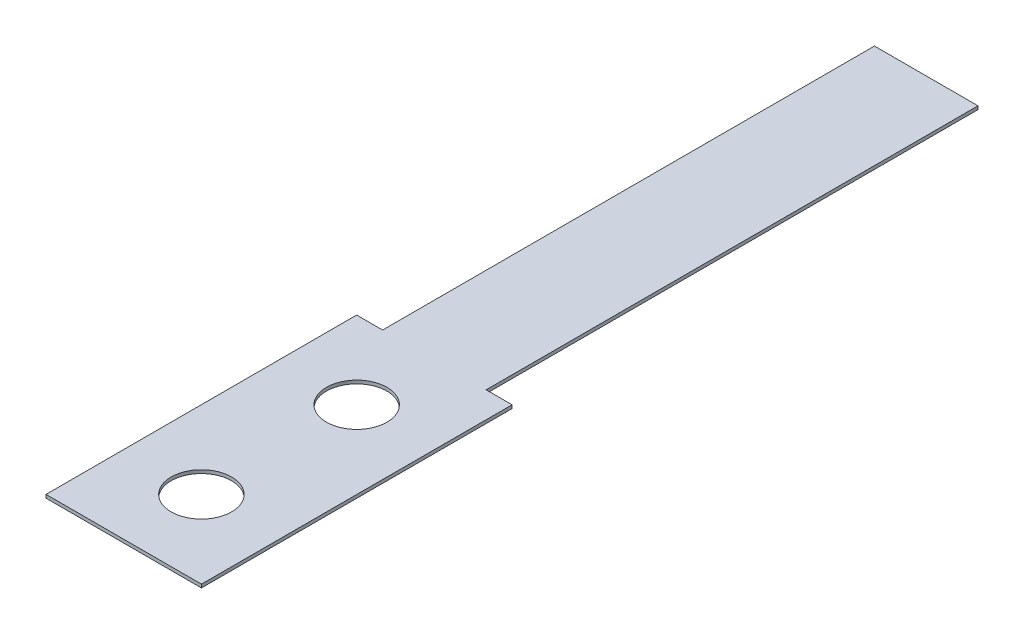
ISO-10303-21;
HEADER;
FILE_DESCRIPTION(('STEP AP214'),'2;1');
FILE_NAME('part.step','',(''),(''),'','','');
FILE_SCHEMA(('AUTOMOTIVE_DESIGN { 1 0 10303 214 1 1 1 1 }'));
ENDSEC;
DATA;
#1=APPLICATION_CONTEXT('core data for automotive mechanical design processes');
#2=APPLICATION_PROTOCOL_DEFINITION('international standard','automotive_design',2000,#1);
#3=PRODUCT_CONTEXT('',#1,'mechanical');
#4=PRODUCT('Part','Part','',(#3));
#5=PRODUCT_RELATED_PRODUCT_CATEGORY('part','',(#4));
#6=PRODUCT_DEFINITION_FORMATION('','',#4);
#7=PRODUCT_DEFINITION_CONTEXT('part definition',#1,'design');
#8=PRODUCT_DEFINITION('design','',#6,#7);
#9=PRODUCT_DEFINITION_SHAPE('','',#8);
#10=(LENGTH_UNIT() NAMED_UNIT(*) SI_UNIT(.MILLI.,.METRE.));
#11=(NAMED_UNIT(*) PLANE_ANGLE_UNIT() SI_UNIT($,.RADIAN.));
#12=(NAMED_UNIT(*) SI_UNIT($,.STERADIAN.) SOLID_ANGLE_UNIT());
#13=UNCERTAINTY_MEASURE_WITH_UNIT(LENGTH_MEASURE(1.E-05),#10,'distance_accuracy_value','');
#14=(GEOMETRIC_REPRESENTATION_CONTEXT(3) GLOBAL_UNCERTAINTY_ASSIGNED_CONTEXT((#13)) GLOBAL_UNIT_ASSIGNED_CONTEXT((#10,
#11,#12)) REPRESENTATION_CONTEXT('',''));
#15=CARTESIAN_POINT('',(0.,0.,0.));
#16=DIRECTION('',(0.,0.,1.));
#17=DIRECTION('',(1.,0.,0.));
#18=AXIS2_PLACEMENT_3D('',#15,#16,#17);
#19=CARTESIAN_POINT('',(-4.76631,-0.2032,-9.525));
#20=DIRECTION('',(0.,0.,-1.));
#21=DIRECTION('',(-1.,0.,0.));
#22=AXIS2_PLACEMENT_3D('',#19,#20,#21);
#23=PLANE('',#22);
#24=DIRECTION('',(-1.,0.,0.));
#25=VECTOR('',#24,1.);
#26=CARTESIAN_POINT('',(-4.76631,-0.2032,-9.525));
#27=LINE('',#26,#25);
#28=CARTESIAN_POINT('',(4.76631,-0.2032,-9.525));
#29=VERTEX_POINT('',#28);
#30=CARTESIAN_POINT('',(3.175,-0.2032,-9.525));
#31=VERTEX_POINT('',#30);
#32=EDGE_CURVE('E173',#29,#31,#27,.T.);
#33=ORIENTED_EDGE('',*,*,#32,.T.);
#34=DIRECTION('',(0.,1.,0.));
#35=VECTOR('',#34,1.);
#36=CARTESIAN_POINT('',(3.175,-0.2032,-9.525));
#37=LINE('',#36,#35);
#38=CARTESIAN_POINT('',(3.17499999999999,0.,-9.525));
#39=VERTEX_POINT('',#38);
#40=EDGE_CURVE('E129',#31,#39,#37,.T.);
#41=ORIENTED_EDGE('',*,*,#40,.T.);
#42=DIRECTION('',(-1.,0.,0.));
#43=VECTOR('',#42,1.);
#44=CARTESIAN_POINT('',(-4.76631,0.,-9.525));
#45=LINE('',#44,#43);
#46=CARTESIAN_POINT('',(4.76631,0.,-9.525));
#47=VERTEX_POINT('',#46);
#48=EDGE_CURVE('E178',#47,#39,#45,.T.);
#49=ORIENTED_EDGE('',*,*,#48,.F.);
#50=DIRECTION('',(0.,1.,0.));
#51=VECTOR('',#50,1.);
#52=CARTESIAN_POINT('',(4.76631,-0.2032,-9.525));
#53=LINE('',#52,#51);
#54=EDGE_CURVE('E87',#29,#47,#53,.T.);
#55=ORIENTED_EDGE('',*,*,#54,.F.);
#56=EDGE_LOOP('',(#33,#41,#49,#55));
#57=FACE_BOUND('',#56,.T.);
#58=ADVANCED_FACE('F37',(#57),#23,.T.);
#59=CARTESIAN_POINT('',(4.76631,-0.2032,9.525));
#60=DIRECTION('',(1.,0.,0.));
#61=DIRECTION('',(0.,0.,-1.));
#62=AXIS2_PLACEMENT_3D('',#59,#60,#61);
#63=PLANE('',#62);
#64=DIRECTION('',(0.,0.,-1.));
#65=VECTOR('',#64,1.);
#66=CARTESIAN_POINT('',(4.76631,0.,9.525));
#67=LINE('',#66,#65);
#68=CARTESIAN_POINT('',(4.76631,0.,9.525));
#69=VERTEX_POINT('',#68);
#70=EDGE_CURVE('E158',#69,#47,#67,.T.);
#71=ORIENTED_EDGE('',*,*,#70,.F.);
#72=DIRECTION('',(0.,1.,0.));
#73=VECTOR('',#72,1.);
#74=CARTESIAN_POINT('',(4.76631,-0.2032,9.525));
#75=LINE('',#74,#73);
#76=CARTESIAN_POINT('',(4.76631,-0.2032,9.525));
#77=VERTEX_POINT('',#76);
#78=EDGE_CURVE('E11',#77,#69,#75,.T.);
#79=ORIENTED_EDGE('',*,*,#78,.F.);
#80=DIRECTION('',(0.,0.,-1.));
#81=VECTOR('',#80,1.);
#82=CARTESIAN_POINT('',(4.76631,-0.2032,9.525));
#83=LINE('',#82,#81);
#84=EDGE_CURVE('E161',#77,#29,#83,.T.);
#85=ORIENTED_EDGE('',*,*,#84,.T.);
#86=ORIENTED_EDGE('',*,*,#54,.T.);
#87=EDGE_LOOP('',(#71,#79,#85,#86));
#88=FACE_BOUND('',#87,.T.);
#89=ADVANCED_FACE('F39',(#88),#63,.T.);
#90=CARTESIAN_POINT('',(-4.76631,-0.2032,9.525));
#91=DIRECTION('',(0.,0.,1.));
#92=DIRECTION('',(1.,0.,0.));
#93=AXIS2_PLACEMENT_3D('',#90,#91,#92);
#94=PLANE('',#93);
#95=DIRECTION('',(1.,0.,0.));
#96=VECTOR('',#95,1.);
#97=CARTESIAN_POINT('',(-4.76631,0.,9.525));
#98=LINE('',#97,#96);
#99=CARTESIAN_POINT('',(-4.76631,0.,9.525));
#100=VERTEX_POINT('',#99);
#101=EDGE_CURVE('E164',#100,#69,#98,.T.);
#102=ORIENTED_EDGE('',*,*,#101,.F.);
#103=DIRECTION('',(0.,1.,0.));
#104=VECTOR('',#103,1.);
#105=CARTESIAN_POINT('',(-4.76631,-0.2032,9.525));
#106=LINE('',#105,#104);
#107=CARTESIAN_POINT('',(-4.76631,-0.2032,9.525));
#108=VERTEX_POINT('',#107);
#109=EDGE_CURVE('E46',#108,#100,#106,.T.);
#110=ORIENTED_EDGE('',*,*,#109,.F.);
#111=DIRECTION('',(1.,0.,0.));
#112=VECTOR('',#111,1.);
#113=CARTESIAN_POINT('',(-4.76631,-0.2032,9.525));
#114=LINE('',#113,#112);
#115=EDGE_CURVE('E192',#108,#77,#114,.T.);
#116=ORIENTED_EDGE('',*,*,#115,.T.);
#117=ORIENTED_EDGE('',*,*,#78,.T.);
#118=EDGE_LOOP('',(#102,#110,#116,#117));
#119=FACE_BOUND('',#118,.T.);
#120=ADVANCED_FACE('F202',(#119),#94,.T.);
#121=CARTESIAN_POINT('',(-4.76631,-0.2032,9.525));
#122=DIRECTION('',(-1.,0.,0.));
#123=DIRECTION('',(0.,0.,1.));
#124=AXIS2_PLACEMENT_3D('',#121,#122,#123);
#125=PLANE('',#124);
#126=DIRECTION('',(0.,0.,1.));
#127=VECTOR('',#126,1.);
#128=CARTESIAN_POINT('',(-4.76631,0.,9.525));
#129=LINE('',#128,#127);
#130=CARTESIAN_POINT('',(-4.76631,0.,-9.525));
#131=VERTEX_POINT('',#130);
#132=EDGE_CURVE('E183',#131,#100,#129,.T.);
#133=ORIENTED_EDGE('',*,*,#132,.F.);
#134=DIRECTION('',(0.,1.,0.));
#135=VECTOR('',#134,1.);
#136=CARTESIAN_POINT('',(-4.76631,-0.2032,-9.525));
#137=LINE('',#136,#135);
#138=CARTESIAN_POINT('',(-4.76631,-0.2032,-9.525));
#139=VERTEX_POINT('',#138);
#140=EDGE_CURVE('E190',#139,#131,#137,.T.);
#141=ORIENTED_EDGE('',*,*,#140,.F.);
#142=DIRECTION('',(0.,0.,1.));
#143=VECTOR('',#142,1.);
#144=CARTESIAN_POINT('',(-4.76631,-0.2032,9.525));
#145=LINE('',#144,#143);
#146=EDGE_CURVE('E167',#139,#108,#145,.T.);
#147=ORIENTED_EDGE('',*,*,#146,.T.);
#148=ORIENTED_EDGE('',*,*,#109,.T.);
#149=EDGE_LOOP('',(#133,#141,#147,#148));
#150=FACE_BOUND('',#149,.T.);
#151=ADVANCED_FACE('F199',(#150),#125,.T.);
#152=DIRECTION('',(0.,1.,0.));
#153=VECTOR('',#152,1.);
#154=CARTESIAN_POINT('',(-3.175,-0.2032,-9.525));
#155=LINE('',#154,#153);
#156=CARTESIAN_POINT('',(-3.175,-0.2032,-9.525));
#157=VERTEX_POINT('',#156);
#158=CARTESIAN_POINT('',(-3.175,0.,-9.525));
#159=VERTEX_POINT('',#158);
#160=EDGE_CURVE('E139',#157,#159,#155,.T.);
#161=ORIENTED_EDGE('',*,*,#160,.F.);
#162=EDGE_CURVE('E163',#157,#139,#27,.T.);
#163=ORIENTED_EDGE('',*,*,#162,.T.);
#164=ORIENTED_EDGE('',*,*,#140,.T.);
#165=EDGE_CURVE('E175',#159,#131,#45,.T.);
#166=ORIENTED_EDGE('',*,*,#165,.F.);
#167=EDGE_LOOP('',(#161,#163,#164,#166));
#168=FACE_BOUND('',#167,.T.);
#169=ADVANCED_FACE('F208',(#168),#23,.T.);
#170=CARTESIAN_POINT('',(0.,-0.2032,0.));
#171=DIRECTION('',(0.,-1.,0.));
#172=DIRECTION('',(0.,0.,-1.));
#173=AXIS2_PLACEMENT_3D('',#170,#171,#172);
#174=PLANE('',#173);
#175=CARTESIAN_POINT('',(0.,-0.2032,4.7625));
#176=DIRECTION('',(0.,1.,0.));
#177=DIRECTION('',(0.,0.,-1.));
#178=AXIS2_PLACEMENT_3D('',#175,#176,#177);
#179=CIRCLE('',#178,1.8542);
#180=CARTESIAN_POINT('',(0.,-0.2032,2.9083));
#181=VERTEX_POINT('',#180);
#182=EDGE_CURVE('E148',#181,#181,#179,.T.);
#183=ORIENTED_EDGE('',*,*,#182,.T.);
#184=EDGE_LOOP('',(#183));
#185=FACE_BOUND('',#184,.T.);
#186=CARTESIAN_POINT('',(0.,-0.2032,-4.7625));
#187=DIRECTION('',(0.,1.,0.));
#188=DIRECTION('',(0.,0.,1.));
#189=AXIS2_PLACEMENT_3D('',#186,#187,#188);
#190=CIRCLE('',#189,1.8542);
#191=CARTESIAN_POINT('',(0.,-0.2032,-2.9083));
#192=VERTEX_POINT('',#191);
#193=EDGE_CURVE('E155',#192,#192,#190,.T.);
#194=ORIENTED_EDGE('',*,*,#193,.T.);
#195=EDGE_LOOP('',(#194));
#196=FACE_BOUND('',#195,.T.);
#197=ORIENTED_EDGE('',*,*,#84,.F.);
#198=ORIENTED_EDGE('',*,*,#115,.F.);
#199=ORIENTED_EDGE('',*,*,#146,.F.);
#200=ORIENTED_EDGE('',*,*,#162,.F.);
#201=DIRECTION('',(0.,0.,1.));
#202=VECTOR('',#201,1.);
#203=CARTESIAN_POINT('',(-3.175,-0.2032,-39.6875));
#204=LINE('',#203,#202);
#205=CARTESIAN_POINT('',(-3.175,-0.2032,-39.6875));
#206=VERTEX_POINT('',#205);
#207=EDGE_CURVE('E119',#206,#157,#204,.T.);
#208=ORIENTED_EDGE('',*,*,#207,.F.);
#209=DIRECTION('',(-1.,0.,0.));
#210=VECTOR('',#209,1.);
#211=CARTESIAN_POINT('',(-3.175,-0.2032,-39.6875));
#212=LINE('',#211,#210);
#213=CARTESIAN_POINT('',(3.175,-0.2032,-39.6875));
#214=VERTEX_POINT('',#213);
#215=EDGE_CURVE('E114',#214,#206,#212,.T.);
#216=ORIENTED_EDGE('',*,*,#215,.F.);
#217=DIRECTION('',(0.,0.,-1.));
#218=VECTOR('',#217,1.);
#219=CARTESIAN_POINT('',(3.175,-0.2032,-39.6875));
#220=LINE('',#219,#218);
#221=EDGE_CURVE('E125',#31,#214,#220,.T.);
#222=ORIENTED_EDGE('',*,*,#221,.F.);
#223=ORIENTED_EDGE('',*,*,#32,.F.);
#224=EDGE_LOOP('',(#197,#198,#199,#200,#208,#216,#222,#223));
#225=FACE_BOUND('',#224,.T.);
#226=ADVANCED_FACE('F124',(#185,#196,#225),#174,.T.);
#227=CARTESIAN_POINT('',(0.,0.,0.));
#228=DIRECTION('',(0.,-1.,0.));
#229=DIRECTION('',(0.,0.,-1.));
#230=AXIS2_PLACEMENT_3D('',#227,#228,#229);
#231=PLANE('',#230);
#232=CARTESIAN_POINT('',(0.,0.,4.7625));
#233=DIRECTION('',(0.,1.,0.));
#234=DIRECTION('',(0.,0.,-1.));
#235=AXIS2_PLACEMENT_3D('',#232,#233,#234);
#236=CIRCLE('',#235,1.8542);
#237=CARTESIAN_POINT('',(0.,0.,2.9083));
#238=VERTEX_POINT('',#237);
#239=EDGE_CURVE('E152',#238,#238,#236,.T.);
#240=ORIENTED_EDGE('',*,*,#239,.F.);
#241=EDGE_LOOP('',(#240));
#242=FACE_BOUND('',#241,.T.);
#243=CARTESIAN_POINT('',(0.,0.,-4.7625));
#244=DIRECTION('',(0.,1.,0.));
#245=DIRECTION('',(0.,0.,1.));
#246=AXIS2_PLACEMENT_3D('',#243,#244,#245);
#247=CIRCLE('',#246,1.8542);
#248=CARTESIAN_POINT('',(0.,0.,-2.9083));
#249=VERTEX_POINT('',#248);
#250=EDGE_CURVE('E151',#249,#249,#247,.T.);
#251=ORIENTED_EDGE('',*,*,#250,.F.);
#252=EDGE_LOOP('',(#251));
#253=FACE_BOUND('',#252,.T.);
#254=ORIENTED_EDGE('',*,*,#70,.T.);
#255=ORIENTED_EDGE('',*,*,#48,.T.);
#256=DIRECTION('',(0.,0.,-1.));
#257=VECTOR('',#256,1.);
#258=CARTESIAN_POINT('',(3.175,0.,-39.6875));
#259=LINE('',#258,#257);
#260=CARTESIAN_POINT('',(3.175,0.,-39.6875));
#261=VERTEX_POINT('',#260);
#262=EDGE_CURVE('E54',#39,#261,#259,.T.);
#263=ORIENTED_EDGE('',*,*,#262,.T.);
#264=DIRECTION('',(-1.,0.,0.));
#265=VECTOR('',#264,1.);
#266=CARTESIAN_POINT('',(-3.175,0.,-39.6875));
#267=LINE('',#266,#265);
#268=CARTESIAN_POINT('',(-3.175,0.,-39.6875));
#269=VERTEX_POINT('',#268);
#270=EDGE_CURVE('E116',#261,#269,#267,.T.);
#271=ORIENTED_EDGE('',*,*,#270,.T.);
#272=DIRECTION('',(0.,0.,1.));
#273=VECTOR('',#272,1.);
#274=CARTESIAN_POINT('',(-3.175,0.,-39.6875));
#275=LINE('',#274,#273);
#276=EDGE_CURVE('E130',#269,#159,#275,.T.);
#277=ORIENTED_EDGE('',*,*,#276,.T.);
#278=ORIENTED_EDGE('',*,*,#165,.T.);
#279=ORIENTED_EDGE('',*,*,#132,.T.);
#280=ORIENTED_EDGE('',*,*,#101,.T.);
#281=EDGE_LOOP('',(#254,#255,#263,#271,#277,#278,#279,#280));
#282=FACE_BOUND('',#281,.T.);
#283=ADVANCED_FACE('F218',(#242,#253,#282),#231,.F.);
#284=CARTESIAN_POINT('',(0.,-0.2032,-4.7625));
#285=DIRECTION('',(0.,1.,0.));
#286=DIRECTION('',(0.,0.,1.));
#287=AXIS2_PLACEMENT_3D('',#284,#285,#286);
#288=CYLINDRICAL_SURFACE('',#287,1.8542);
#289=ORIENTED_EDGE('',*,*,#193,.F.);
#290=EDGE_LOOP('',(#289));
#291=FACE_BOUND('',#290,.T.);
#292=ORIENTED_EDGE('',*,*,#250,.T.);
#293=EDGE_LOOP('',(#292));
#294=FACE_BOUND('',#293,.T.);
#295=ADVANCED_FACE('F230',(#291,#294),#288,.F.);
#296=CARTESIAN_POINT('',(0.,-0.2032,4.7625));
#297=DIRECTION('',(0.,1.,0.));
#298=DIRECTION('',(0.,0.,1.));
#299=AXIS2_PLACEMENT_3D('',#296,#297,#298);
#300=CYLINDRICAL_SURFACE('',#299,1.8542);
#301=ORIENTED_EDGE('',*,*,#182,.F.);
#302=EDGE_LOOP('',(#301));
#303=FACE_BOUND('',#302,.T.);
#304=ORIENTED_EDGE('',*,*,#239,.T.);
#305=EDGE_LOOP('',(#304));
#306=FACE_BOUND('',#305,.T.);
#307=ADVANCED_FACE('F236',(#303,#306),#300,.F.);
#308=CARTESIAN_POINT('',(3.175,-0.2032,-39.6875));
#309=DIRECTION('',(1.,0.,0.));
#310=DIRECTION('',(0.,0.,-1.));
#311=AXIS2_PLACEMENT_3D('',#308,#309,#310);
#312=PLANE('',#311);
#313=ORIENTED_EDGE('',*,*,#262,.F.);
#314=ORIENTED_EDGE('',*,*,#40,.F.);
#315=ORIENTED_EDGE('',*,*,#221,.T.);
#316=DIRECTION('',(0.,1.,0.));
#317=VECTOR('',#316,1.);
#318=CARTESIAN_POINT('',(3.175,-0.2032,-39.6875));
#319=LINE('',#318,#317);
#320=EDGE_CURVE('E111',#214,#261,#319,.T.);
#321=ORIENTED_EDGE('',*,*,#320,.T.);
#322=EDGE_LOOP('',(#313,#314,#315,#321));
#323=FACE_BOUND('',#322,.T.);
#324=ADVANCED_FACE('F128',(#323),#312,.T.);
#325=CARTESIAN_POINT('',(-3.175,-0.2032,-39.6875));
#326=DIRECTION('',(-1.,0.,0.));
#327=DIRECTION('',(0.,0.,1.));
#328=AXIS2_PLACEMENT_3D('',#325,#326,#327);
#329=PLANE('',#328);
#330=ORIENTED_EDGE('',*,*,#276,.F.);
#331=DIRECTION('',(0.,1.,0.));
#332=VECTOR('',#331,1.);
#333=CARTESIAN_POINT('',(-3.175,-0.2032,-39.6875));
#334=LINE('',#333,#332);
#335=EDGE_CURVE('E118',#206,#269,#334,.T.);
#336=ORIENTED_EDGE('',*,*,#335,.F.);
#337=ORIENTED_EDGE('',*,*,#207,.T.);
#338=ORIENTED_EDGE('',*,*,#160,.T.);
#339=EDGE_LOOP('',(#330,#336,#337,#338));
#340=FACE_BOUND('',#339,.T.);
#341=ADVANCED_FACE('F225',(#340),#329,.T.);
#342=CARTESIAN_POINT('',(-3.175,-0.2032,-39.6875));
#343=DIRECTION('',(0.,0.,-1.));
#344=DIRECTION('',(-1.,0.,0.));
#345=AXIS2_PLACEMENT_3D('',#342,#343,#344);
#346=PLANE('',#345);
#347=ORIENTED_EDGE('',*,*,#270,.F.);
#348=ORIENTED_EDGE('',*,*,#320,.F.);
#349=ORIENTED_EDGE('',*,*,#215,.T.);
#350=ORIENTED_EDGE('',*,*,#335,.T.);
#351=EDGE_LOOP('',(#347,#348,#349,#350));
#352=FACE_BOUND('',#351,.T.);
#353=ADVANCED_FACE('F113',(#352),#346,.T.);
#354=CLOSED_SHELL('',(#58,#89,#120,#151,#169,#226,#283,#295,#307,#324,#341,#353));
#355=MANIFOLD_SOLID_BREP('B2',#354);
#356=ADVANCED_BREP_SHAPE_REPRESENTATION('',(#18,#355),#14);
#357=SHAPE_DEFINITION_REPRESENTATION(#9,#356);
ENDSEC;
END-ISO-10303-21;
